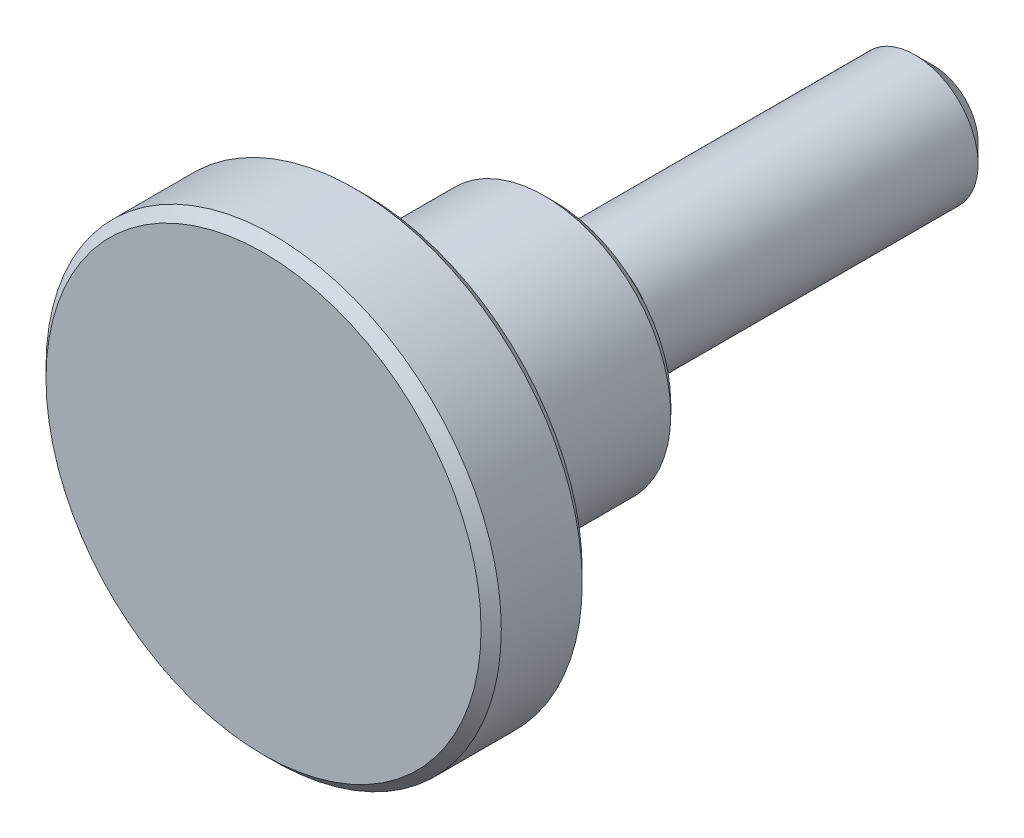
ISO-10303-21;
HEADER;
FILE_DESCRIPTION(('STEP AP214'),'2;1');
FILE_NAME('part.step','',(''),(''),'','','');
FILE_SCHEMA(('AUTOMOTIVE_DESIGN { 1 0 10303 214 1 1 1 1 }'));
ENDSEC;
DATA;
#1=APPLICATION_CONTEXT('core data for automotive mechanical design processes');
#2=APPLICATION_PROTOCOL_DEFINITION('international standard','automotive_design',2000,#1);
#3=PRODUCT_CONTEXT('',#1,'mechanical');
#4=PRODUCT('Part','Part','',(#3));
#5=PRODUCT_RELATED_PRODUCT_CATEGORY('part','',(#4));
#6=PRODUCT_DEFINITION_FORMATION('','',#4);
#7=PRODUCT_DEFINITION_CONTEXT('part definition',#1,'design');
#8=PRODUCT_DEFINITION('design','',#6,#7);
#9=PRODUCT_DEFINITION_SHAPE('','',#8);
#10=(LENGTH_UNIT() NAMED_UNIT(*) SI_UNIT(.MILLI.,.METRE.));
#11=(NAMED_UNIT(*) PLANE_ANGLE_UNIT() SI_UNIT($,.RADIAN.));
#12=(NAMED_UNIT(*) SI_UNIT($,.STERADIAN.) SOLID_ANGLE_UNIT());
#13=UNCERTAINTY_MEASURE_WITH_UNIT(LENGTH_MEASURE(1.E-05),#10,'distance_accuracy_value','');
#14=(GEOMETRIC_REPRESENTATION_CONTEXT(3) GLOBAL_UNCERTAINTY_ASSIGNED_CONTEXT((#13)) GLOBAL_UNIT_ASSIGNED_CONTEXT((#10,
#11,#12)) REPRESENTATION_CONTEXT('',''));
#15=CARTESIAN_POINT('',(0.,0.,0.));
#16=DIRECTION('',(0.,0.,1.));
#17=DIRECTION('',(1.,0.,0.));
#18=AXIS2_PLACEMENT_3D('',#15,#16,#17);
#19=CARTESIAN_POINT('',(0.,3.5,-30.));
#20=DIRECTION('',(0.,0.,-1.));
#21=DIRECTION('',(-1.,0.,0.));
#22=AXIS2_PLACEMENT_3D('',#19,#20,#21);
#23=PLANE('',#22);
#24=CARTESIAN_POINT('',(0.,0.,-30.));
#25=DIRECTION('',(0.,0.,-1.));
#26=DIRECTION('',(-1.,0.,0.));
#27=AXIS2_PLACEMENT_3D('',#24,#25,#26);
#28=CIRCLE('',#27,3.5);
#29=CARTESIAN_POINT('',(-3.5,0.,-30.));
#30=VERTEX_POINT('',#29);
#31=EDGE_CURVE('E8',#30,#30,#28,.T.);
#32=ORIENTED_EDGE('',*,*,#31,.T.);
#33=EDGE_LOOP('',(#32));
#34=FACE_BOUND('',#33,.T.);
#35=ADVANCED_FACE('F12',(#34),#23,.T.);
#36=CARTESIAN_POINT('',(0.,0.,-30.));
#37=DIRECTION('',(0.,0.,1.));
#38=DIRECTION('',(1.,0.,0.));
#39=AXIS2_PLACEMENT_3D('',#36,#37,#38);
#40=CONICAL_SURFACE('',#39,3.5,0.785398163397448);
#41=CARTESIAN_POINT('',(0.,0.,-28.5));
#42=DIRECTION('',(0.,0.,-1.));
#43=DIRECTION('',(-1.,0.,0.));
#44=AXIS2_PLACEMENT_3D('',#41,#42,#43);
#45=CIRCLE('',#44,5.);
#46=CARTESIAN_POINT('',(-5.,0.,-28.5));
#47=VERTEX_POINT('',#46);
#48=EDGE_CURVE('E18',#47,#47,#45,.T.);
#49=ORIENTED_EDGE('',*,*,#48,.T.);
#50=EDGE_LOOP('',(#49));
#51=FACE_BOUND('',#50,.T.);
#52=ORIENTED_EDGE('',*,*,#31,.F.);
#53=EDGE_LOOP('',(#52));
#54=FACE_BOUND('',#53,.T.);
#55=ADVANCED_FACE('F79',(#51,#54),#40,.T.);
#56=CARTESIAN_POINT('',(0.,0.,-35.));
#57=DIRECTION('',(0.,0.,-1.));
#58=DIRECTION('',(-1.,0.,0.));
#59=AXIS2_PLACEMENT_3D('',#56,#57,#58);
#60=CYLINDRICAL_SURFACE('',#59,5.);
#61=CARTESIAN_POINT('',(0.,0.,-3.));
#62=DIRECTION('',(0.,0.,-1.));
#63=DIRECTION('',(-1.,0.,0.));
#64=AXIS2_PLACEMENT_3D('',#61,#62,#63);
#65=CIRCLE('',#64,5.);
#66=CARTESIAN_POINT('',(-5.,0.,-3.));
#67=VERTEX_POINT('',#66);
#68=EDGE_CURVE('E22',#67,#67,#65,.T.);
#69=ORIENTED_EDGE('',*,*,#68,.T.);
#70=EDGE_LOOP('',(#69));
#71=FACE_BOUND('',#70,.T.);
#72=ORIENTED_EDGE('',*,*,#48,.F.);
#73=EDGE_LOOP('',(#72));
#74=FACE_BOUND('',#73,.T.);
#75=ADVANCED_FACE('F84',(#71,#74),#60,.T.);
#76=CARTESIAN_POINT('',(0.,5.,-3.));
#77=DIRECTION('',(0.,0.,1.));
#78=DIRECTION('',(1.,0.,0.));
#79=AXIS2_PLACEMENT_3D('',#76,#77,#78);
#80=PLANE('',#79);
#81=CARTESIAN_POINT('',(0.,0.,-3.));
#82=DIRECTION('',(0.,0.,-1.));
#83=DIRECTION('',(-1.,0.,0.));
#84=AXIS2_PLACEMENT_3D('',#81,#82,#83);
#85=CIRCLE('',#84,4.65);
#86=CARTESIAN_POINT('',(-4.65,0.,-3.));
#87=VERTEX_POINT('',#86);
#88=EDGE_CURVE('E26',#87,#87,#85,.T.);
#89=ORIENTED_EDGE('',*,*,#88,.T.);
#90=EDGE_LOOP('',(#89));
#91=FACE_BOUND('',#90,.T.);
#92=ORIENTED_EDGE('',*,*,#68,.F.);
#93=EDGE_LOOP('',(#92));
#94=FACE_BOUND('',#93,.T.);
#95=ADVANCED_FACE('F89',(#91,#94),#80,.T.);
#96=CARTESIAN_POINT('',(0.,0.,-2.2));
#97=DIRECTION('',(0.,0.,-1.));
#98=DIRECTION('',(-1.,0.,0.));
#99=AXIS2_PLACEMENT_3D('',#96,#97,#98);
#100=TOROIDAL_SURFACE('',#99,4.65,0.8);
#101=CARTESIAN_POINT('',(0.,0.,-2.2));
#102=DIRECTION('',(0.,0.,-1.));
#103=DIRECTION('',(-1.,0.,0.));
#104=AXIS2_PLACEMENT_3D('',#101,#102,#103);
#105=CIRCLE('',#104,3.85);
#106=CARTESIAN_POINT('',(-3.85,0.,-2.2));
#107=VERTEX_POINT('',#106);
#108=EDGE_CURVE('E31',#107,#107,#105,.T.);
#109=ORIENTED_EDGE('',*,*,#108,.T.);
#110=EDGE_LOOP('',(#109));
#111=FACE_BOUND('',#110,.T.);
#112=ORIENTED_EDGE('',*,*,#88,.F.);
#113=EDGE_LOOP('',(#112));
#114=FACE_BOUND('',#113,.T.);
#115=ADVANCED_FACE('F96',(#111,#114),#100,.F.);
#116=CARTESIAN_POINT('',(0.,0.,-35.));
#117=DIRECTION('',(0.,0.,-1.));
#118=DIRECTION('',(-1.,0.,0.));
#119=AXIS2_PLACEMENT_3D('',#116,#117,#118);
#120=CYLINDRICAL_SURFACE('',#119,3.85);
#121=CARTESIAN_POINT('',(0.,0.,-0.800000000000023));
#122=DIRECTION('',(0.,0.,-1.));
#123=DIRECTION('',(-1.,0.,0.));
#124=AXIS2_PLACEMENT_3D('',#121,#122,#123);
#125=CIRCLE('',#124,3.85);
#126=CARTESIAN_POINT('',(-3.85,0.,-0.800000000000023));
#127=VERTEX_POINT('',#126);
#128=EDGE_CURVE('E34',#127,#127,#125,.T.);
#129=ORIENTED_EDGE('',*,*,#128,.T.);
#130=EDGE_LOOP('',(#129));
#131=FACE_BOUND('',#130,.T.);
#132=ORIENTED_EDGE('',*,*,#108,.F.);
#133=EDGE_LOOP('',(#132));
#134=FACE_BOUND('',#133,.T.);
#135=ADVANCED_FACE('F100',(#131,#134),#120,.T.);
#136=CARTESIAN_POINT('',(0.,0.,-0.800000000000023));
#137=DIRECTION('',(0.,0.,-1.));
#138=DIRECTION('',(-1.,0.,0.));
#139=AXIS2_PLACEMENT_3D('',#136,#137,#138);
#140=TOROIDAL_SURFACE('',#139,4.65,0.800000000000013);
#141=CARTESIAN_POINT('',(0.,0.,0.));
#142=DIRECTION('',(0.,0.,-1.));
#143=DIRECTION('',(-1.,0.,0.));
#144=AXIS2_PLACEMENT_3D('',#141,#142,#143);
#145=CIRCLE('',#144,4.65000000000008);
#146=CARTESIAN_POINT('',(-4.65000000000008,0.,0.));
#147=VERTEX_POINT('',#146);
#148=EDGE_CURVE('E37',#147,#147,#145,.T.);
#149=ORIENTED_EDGE('',*,*,#148,.T.);
#150=EDGE_LOOP('',(#149));
#151=FACE_BOUND('',#150,.T.);
#152=ORIENTED_EDGE('',*,*,#128,.F.);
#153=EDGE_LOOP('',(#152));
#154=FACE_BOUND('',#153,.T.);
#155=ADVANCED_FACE('F104',(#151,#154),#140,.F.);
#156=CARTESIAN_POINT('',(0.,9.2,0.));
#157=DIRECTION('',(0.,0.,-1.));
#158=DIRECTION('',(-1.,0.,0.));
#159=AXIS2_PLACEMENT_3D('',#156,#157,#158);
#160=PLANE('',#159);
#161=CARTESIAN_POINT('',(0.,0.,0.));
#162=DIRECTION('',(0.,0.,-1.));
#163=DIRECTION('',(-1.,0.,0.));
#164=AXIS2_PLACEMENT_3D('',#161,#162,#163);
#165=CIRCLE('',#164,9.2);
#166=CARTESIAN_POINT('',(-9.2,0.,0.));
#167=VERTEX_POINT('',#166);
#168=EDGE_CURVE('E40',#167,#167,#165,.T.);
#169=ORIENTED_EDGE('',*,*,#168,.T.);
#170=EDGE_LOOP('',(#169));
#171=FACE_BOUND('',#170,.T.);
#172=ORIENTED_EDGE('',*,*,#148,.F.);
#173=EDGE_LOOP('',(#172));
#174=FACE_BOUND('',#173,.T.);
#175=ADVANCED_FACE('F108',(#171,#174),#160,.T.);
#176=CARTESIAN_POINT('',(0.,0.,0.));
#177=DIRECTION('',(0.,0.,1.));
#178=DIRECTION('',(1.,0.,0.));
#179=AXIS2_PLACEMENT_3D('',#176,#177,#178);
#180=CONICAL_SURFACE('',#179,9.2,0.785398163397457);
#181=CARTESIAN_POINT('',(0.,0.,0.8));
#182=DIRECTION('',(0.,0.,-1.));
#183=DIRECTION('',(-1.,0.,0.));
#184=AXIS2_PLACEMENT_3D('',#181,#182,#183);
#185=CIRCLE('',#184,10.);
#186=CARTESIAN_POINT('',(-10.,0.,0.8));
#187=VERTEX_POINT('',#186);
#188=EDGE_CURVE('E43',#187,#187,#185,.T.);
#189=ORIENTED_EDGE('',*,*,#188,.T.);
#190=EDGE_LOOP('',(#189));
#191=FACE_BOUND('',#190,.T.);
#192=ORIENTED_EDGE('',*,*,#168,.F.);
#193=EDGE_LOOP('',(#192));
#194=FACE_BOUND('',#193,.T.);
#195=ADVANCED_FACE('F112',(#191,#194),#180,.T.);
#196=CARTESIAN_POINT('',(0.,0.,-35.));
#197=DIRECTION('',(0.,0.,-1.));
#198=DIRECTION('',(-1.,0.,0.));
#199=AXIS2_PLACEMENT_3D('',#196,#197,#198);
#200=CYLINDRICAL_SURFACE('',#199,10.);
#201=CARTESIAN_POINT('',(0.,0.,13.));
#202=DIRECTION('',(0.,0.,-1.));
#203=DIRECTION('',(-1.,0.,0.));
#204=AXIS2_PLACEMENT_3D('',#201,#202,#203);
#205=CIRCLE('',#204,10.);
#206=CARTESIAN_POINT('',(-10.,0.,13.));
#207=VERTEX_POINT('',#206);
#208=EDGE_CURVE('E46',#207,#207,#205,.T.);
#209=ORIENTED_EDGE('',*,*,#208,.T.);
#210=EDGE_LOOP('',(#209));
#211=FACE_BOUND('',#210,.T.);
#212=ORIENTED_EDGE('',*,*,#188,.F.);
#213=EDGE_LOOP('',(#212));
#214=FACE_BOUND('',#213,.T.);
#215=ADVANCED_FACE('F116',(#211,#214),#200,.T.);
#216=CARTESIAN_POINT('',(0.,0.,13.));
#217=DIRECTION('',(0.,0.,-1.));
#218=DIRECTION('',(-1.,0.,0.));
#219=AXIS2_PLACEMENT_3D('',#216,#217,#218);
#220=TOROIDAL_SURFACE('',#219,12.,2.);
#221=CARTESIAN_POINT('',(0.,0.,15.));
#222=DIRECTION('',(0.,0.,-1.));
#223=DIRECTION('',(-1.,0.,0.));
#224=AXIS2_PLACEMENT_3D('',#221,#222,#223);
#225=CIRCLE('',#224,12.);
#226=CARTESIAN_POINT('',(-12.,0.,15.));
#227=VERTEX_POINT('',#226);
#228=EDGE_CURVE('E49',#227,#227,#225,.T.);
#229=ORIENTED_EDGE('',*,*,#228,.T.);
#230=EDGE_LOOP('',(#229));
#231=FACE_BOUND('',#230,.T.);
#232=ORIENTED_EDGE('',*,*,#208,.F.);
#233=EDGE_LOOP('',(#232));
#234=FACE_BOUND('',#233,.T.);
#235=ADVANCED_FACE('F120',(#231,#234),#220,.F.);
#236=CARTESIAN_POINT('',(0.,17.2,15.));
#237=DIRECTION('',(0.,0.,-1.));
#238=DIRECTION('',(-1.,0.,0.));
#239=AXIS2_PLACEMENT_3D('',#236,#237,#238);
#240=PLANE('',#239);
#241=CARTESIAN_POINT('',(0.,0.,15.));
#242=DIRECTION('',(0.,0.,-1.));
#243=DIRECTION('',(-1.,0.,0.));
#244=AXIS2_PLACEMENT_3D('',#241,#242,#243);
#245=CIRCLE('',#244,17.2);
#246=CARTESIAN_POINT('',(-17.2,0.,15.));
#247=VERTEX_POINT('',#246);
#248=EDGE_CURVE('E52',#247,#247,#245,.T.);
#249=ORIENTED_EDGE('',*,*,#248,.T.);
#250=EDGE_LOOP('',(#249));
#251=FACE_BOUND('',#250,.T.);
#252=ORIENTED_EDGE('',*,*,#228,.F.);
#253=EDGE_LOOP('',(#252));
#254=FACE_BOUND('',#253,.T.);
#255=ADVANCED_FACE('F124',(#251,#254),#240,.T.);
#256=CARTESIAN_POINT('',(0.,0.,15.));
#257=DIRECTION('',(0.,0.,1.));
#258=DIRECTION('',(1.,0.,0.));
#259=AXIS2_PLACEMENT_3D('',#256,#257,#258);
#260=CONICAL_SURFACE('',#259,17.2,0.785398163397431);
#261=CARTESIAN_POINT('',(0.,0.,15.8));
#262=DIRECTION('',(0.,0.,-1.));
#263=DIRECTION('',(-1.,0.,0.));
#264=AXIS2_PLACEMENT_3D('',#261,#262,#263);
#265=CIRCLE('',#264,18.);
#266=CARTESIAN_POINT('',(-18.,0.,15.8));
#267=VERTEX_POINT('',#266);
#268=EDGE_CURVE('E55',#267,#267,#265,.T.);
#269=ORIENTED_EDGE('',*,*,#268,.T.);
#270=EDGE_LOOP('',(#269));
#271=FACE_BOUND('',#270,.T.);
#272=ORIENTED_EDGE('',*,*,#248,.F.);
#273=EDGE_LOOP('',(#272));
#274=FACE_BOUND('',#273,.T.);
#275=ADVANCED_FACE('F128',(#271,#274),#260,.T.);
#276=CARTESIAN_POINT('',(0.,0.,-35.));
#277=DIRECTION('',(0.,0.,-1.));
#278=DIRECTION('',(-1.,0.,0.));
#279=AXIS2_PLACEMENT_3D('',#276,#277,#278);
#280=CYLINDRICAL_SURFACE('',#279,18.);
#281=CARTESIAN_POINT('',(0.,0.,22.2));
#282=DIRECTION('',(0.,0.,-1.));
#283=DIRECTION('',(-1.,0.,0.));
#284=AXIS2_PLACEMENT_3D('',#281,#282,#283);
#285=CIRCLE('',#284,18.);
#286=CARTESIAN_POINT('',(-18.,0.,22.2));
#287=VERTEX_POINT('',#286);
#288=EDGE_CURVE('E58',#287,#287,#285,.T.);
#289=ORIENTED_EDGE('',*,*,#288,.T.);
#290=EDGE_LOOP('',(#289));
#291=FACE_BOUND('',#290,.T.);
#292=ORIENTED_EDGE('',*,*,#268,.F.);
#293=EDGE_LOOP('',(#292));
#294=FACE_BOUND('',#293,.T.);
#295=ADVANCED_FACE('F76',(#291,#294),#280,.T.);
#296=CARTESIAN_POINT('',(0.,0.,22.2));
#297=DIRECTION('',(0.,0.,-1.));
#298=DIRECTION('',(-1.,0.,0.));
#299=AXIS2_PLACEMENT_3D('',#296,#297,#298);
#300=CONICAL_SURFACE('',#299,18.,0.785398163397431);
#301=CARTESIAN_POINT('',(0.,0.,23.));
#302=DIRECTION('',(0.,0.,-1.));
#303=DIRECTION('',(-1.,0.,0.));
#304=AXIS2_PLACEMENT_3D('',#301,#302,#303);
#305=CIRCLE('',#304,17.2);
#306=CARTESIAN_POINT('',(-17.2,0.,23.));
#307=VERTEX_POINT('',#306);
#308=EDGE_CURVE('E61',#307,#307,#305,.T.);
#309=ORIENTED_EDGE('',*,*,#308,.T.);
#310=EDGE_LOOP('',(#309));
#311=FACE_BOUND('',#310,.T.);
#312=ORIENTED_EDGE('',*,*,#288,.F.);
#313=EDGE_LOOP('',(#312));
#314=FACE_BOUND('',#313,.T.);
#315=ADVANCED_FACE('F65',(#311,#314),#300,.T.);
#316=CARTESIAN_POINT('',(0.,17.2,23.));
#317=DIRECTION('',(0.,0.,1.));
#318=DIRECTION('',(1.,0.,0.));
#319=AXIS2_PLACEMENT_3D('',#316,#317,#318);
#320=PLANE('',#319);
#321=ORIENTED_EDGE('',*,*,#308,.F.);
#322=EDGE_LOOP('',(#321));
#323=FACE_BOUND('',#322,.T.);
#324=ADVANCED_FACE('F68',(#323),#320,.T.);
#325=CLOSED_SHELL('',(#35,#55,#75,#95,#115,#135,#155,#175,#195,#215,#235,#255,#275,#295,#315,#324));
#326=MANIFOLD_SOLID_BREP('B1',#325);
#327=ADVANCED_BREP_SHAPE_REPRESENTATION('',(#18,#326),#14);
#328=SHAPE_DEFINITION_REPRESENTATION(#9,#327);
ENDSEC;
END-ISO-10303-21;
